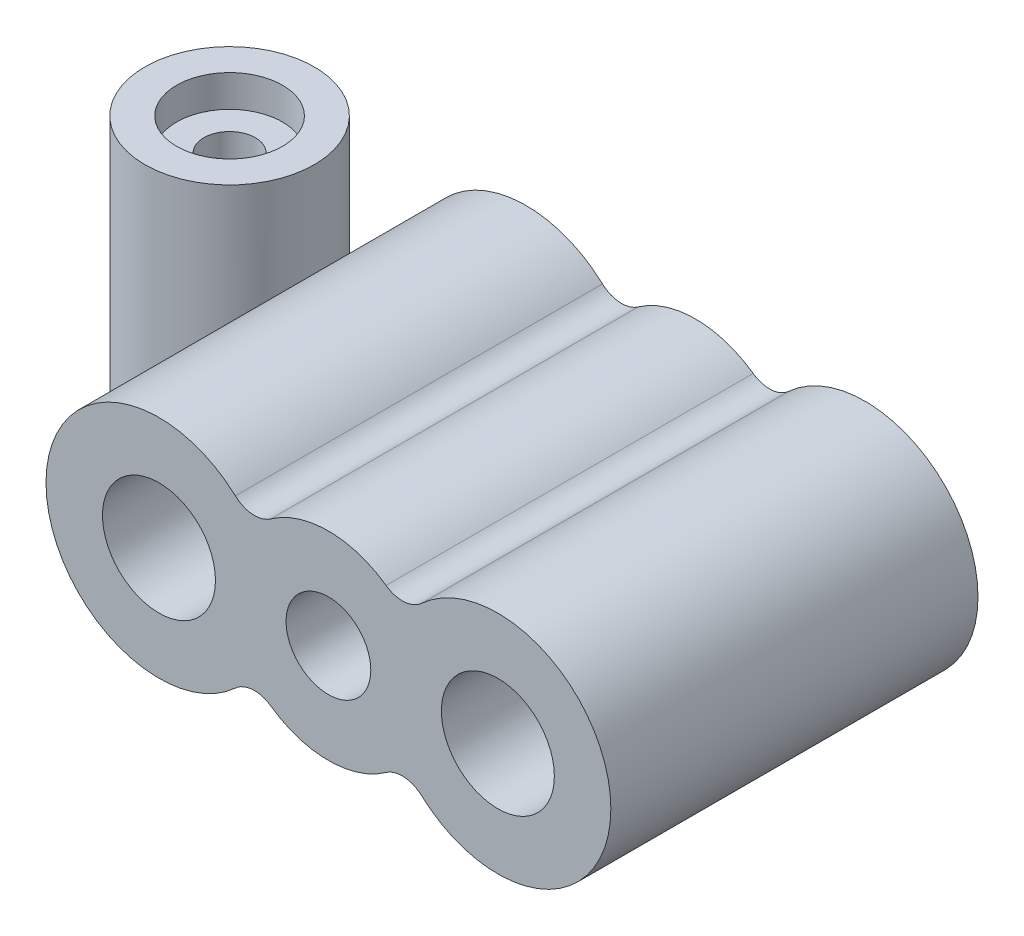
from build123d import *

# Parameters (mm, degrees)
EXTRUDE1_DEPTH                                      = 20.6375
SKETCH3_R                                           = 9.525
EXTRUDE3_DEPTH                                      = 19.05
SKETCH4_R                                           = 6.35
CUT_EXTRUDE1_DEPTH                                  = 66.838201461
SKETCH5_R                                           = 4.7625
CUT_EXTRUDE2_DEPTH                                  = 82.517900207
SKETCH6_R                                           = 6.35
CUT_EXTRUDE3_DEPTH                                  = 98.675904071
CBORE_FOR_12_BINDING_HEAD_MACHINE_SCREW_D           = 5.7912
CBORE_FOR_12_BINDING_HEAD_MACHINE_SCREW_CBORE_D     = 11.90752
CBORE_FOR_12_BINDING_HEAD_MACHINE_SCREW_CBORE_DEPTH = 3.5814


with BuildPart() as part:
    # Sketch1 → Extrude1 (new, symmetric)
    with BuildSketch(Plane.XY):
        with BuildLine():
            ThreePointArc((-6.476145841, -9.108375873), (0, -11.176), (6.476145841, -9.108375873))
            ThreePointArc((6.476145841, -9.108375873), (8.513414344, -8.527128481), (10.462768, -9.356786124))
            ThreePointArc((10.462768, -9.356786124), (31.75, 0), (10.462768, 9.356786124))
            ThreePointArc((10.462768, 9.356786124), (8.513414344, 8.527128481), (6.476145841, 9.108375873))
            ThreePointArc((6.476145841, 9.108375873), (0, 11.176), (-6.476145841, 9.108375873))
            ThreePointArc((-6.476145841, 9.108375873), (-8.513414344, 8.527128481), (-10.462768, 9.356786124))
            ThreePointArc((-10.462768, 9.356786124), (-31.75, 0), (-10.462768, -9.356786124))
            ThreePointArc((-10.462768, -9.356786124), (-8.513414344, -8.527128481), (-6.476145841, -9.108375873))
        make_face()
    extrude(amount=EXTRUDE1_DEPTH, both=True)

    # Sketch3 → Extrude3 (add, symmetric)
    with BuildSketch(Plane(origin=(0, 0, 0), x_dir=(1, 0, 0), z_dir=(0, 1, 0))):
        with Locations(Location((-38.1, 6.35, 0), (0, 0, 270))):
            Circle(SKETCH3_R)
    extrude(amount=EXTRUDE3_DEPTH, both=True)

    # Sketch4 → Cut-Extrude1 (cut, through all)
    with BuildSketch(Plane.XY.offset(20.6375)):
        with Locations((-19.05, 0)):
            Circle(SKETCH4_R)
    extrude(amount=-CUT_EXTRUDE1_DEPTH, mode=Mode.SUBTRACT)

    # Sketch5 → Cut-Extrude2 (cut, through all)
    with BuildSketch(Plane(origin=(19.926829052, 0.39975052, 20.6375), x_dir=(1, 0, 0), z_dir=(0, 0, 1))):
        with Locations((-19.926829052, -0.39975052)):
            Circle(SKETCH5_R)
    extrude(amount=-CUT_EXTRUDE2_DEPTH, mode=Mode.SUBTRACT)

    # Sketch6 → Cut-Extrude3 (cut, through all)
    with BuildSketch(Plane(origin=(38.789057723, -0.174130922, 20.6375), x_dir=(1, 0, 0), z_dir=(0, 0, 1))):
        with Locations((-19.739057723, 0.174130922)):
            Circle(SKETCH6_R)
    extrude(amount=-CUT_EXTRUDE3_DEPTH, mode=Mode.SUBTRACT)

    # CBORE for _12 Binding Head Machine Screw (through all)
    with Locations(Plane(origin=(0, 19.05, 0), x_dir=(-1, 0, 0), z_dir=(0, 1, 0))):
        with Locations((38.1, -6.35)):
            CounterBoreHole(CBORE_FOR_12_BINDING_HEAD_MACHINE_SCREW_D / 2, CBORE_FOR_12_BINDING_HEAD_MACHINE_SCREW_CBORE_D / 2, CBORE_FOR_12_BINDING_HEAD_MACHINE_SCREW_CBORE_DEPTH)


solid = part.part
